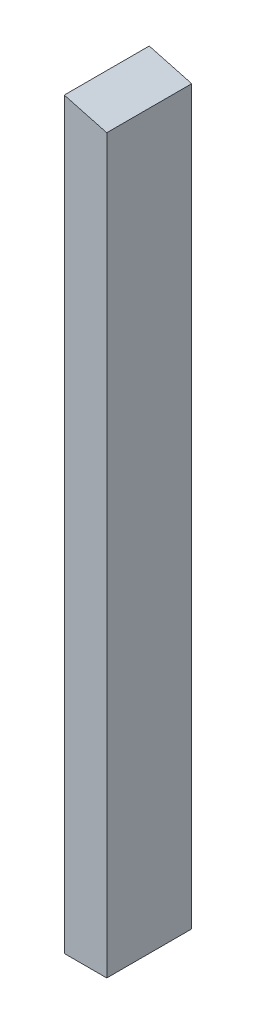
ISO-10303-21;
HEADER;
FILE_DESCRIPTION(('STEP AP214'),'2;1');
FILE_NAME('part.step','',(''),(''),'','','');
FILE_SCHEMA(('AUTOMOTIVE_DESIGN { 1 0 10303 214 1 1 1 1 }'));
ENDSEC;
DATA;
#1=APPLICATION_CONTEXT('core data for automotive mechanical design processes');
#2=APPLICATION_PROTOCOL_DEFINITION('international standard','automotive_design',2000,#1);
#3=PRODUCT_CONTEXT('',#1,'mechanical');
#4=PRODUCT('Part','Part','',(#3));
#5=PRODUCT_RELATED_PRODUCT_CATEGORY('part','',(#4));
#6=PRODUCT_DEFINITION_FORMATION('','',#4);
#7=PRODUCT_DEFINITION_CONTEXT('part definition',#1,'design');
#8=PRODUCT_DEFINITION('design','',#6,#7);
#9=PRODUCT_DEFINITION_SHAPE('','',#8);
#10=(LENGTH_UNIT() NAMED_UNIT(*) SI_UNIT(.MILLI.,.METRE.));
#11=(NAMED_UNIT(*) PLANE_ANGLE_UNIT() SI_UNIT($,.RADIAN.));
#12=(NAMED_UNIT(*) SI_UNIT($,.STERADIAN.) SOLID_ANGLE_UNIT());
#13=UNCERTAINTY_MEASURE_WITH_UNIT(LENGTH_MEASURE(1.E-05),#10,'distance_accuracy_value','');
#14=(GEOMETRIC_REPRESENTATION_CONTEXT(3) GLOBAL_UNCERTAINTY_ASSIGNED_CONTEXT((#13)) GLOBAL_UNIT_ASSIGNED_CONTEXT((#10,
#11,#12)) REPRESENTATION_CONTEXT('',''));
#15=CARTESIAN_POINT('',(0.,0.,0.));
#16=DIRECTION('',(0.,0.,1.));
#17=DIRECTION('',(1.,0.,0.));
#18=AXIS2_PLACEMENT_3D('',#15,#16,#17);
#19=CARTESIAN_POINT('',(3619.88097263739,2786.4066057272,-80.));
#20=DIRECTION('',(0.,-1.,0.));
#21=DIRECTION('',(0.,0.,-1.));
#22=AXIS2_PLACEMENT_3D('',#19,#20,#21);
#23=PLANE('',#22);
#24=DIRECTION('',(1.,0.,0.));
#25=VECTOR('',#24,1.);
#26=CARTESIAN_POINT('',(3619.88097263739,2786.4066057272,0.));
#27=LINE('',#26,#25);
#28=CARTESIAN_POINT('',(3619.88097263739,2786.4066057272,0.));
#29=VERTEX_POINT('',#28);
#30=CARTESIAN_POINT('',(3659.88097263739,2786.4066057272,0.));
#31=VERTEX_POINT('',#30);
#32=EDGE_CURVE('E136',#29,#31,#27,.T.);
#33=ORIENTED_EDGE('',*,*,#32,.F.);
#34=DIRECTION('',(0.,0.,1.));
#35=VECTOR('',#34,1.);
#36=CARTESIAN_POINT('',(3619.88097263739,2786.4066057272,-80.));
#37=LINE('',#36,#35);
#38=CARTESIAN_POINT('',(3619.88097263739,2786.4066057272,-80.));
#39=VERTEX_POINT('',#38);
#40=EDGE_CURVE('E153',#39,#29,#37,.T.);
#41=ORIENTED_EDGE('',*,*,#40,.F.);
#42=DIRECTION('',(1.,0.,0.));
#43=VECTOR('',#42,1.);
#44=CARTESIAN_POINT('',(3619.88097263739,2786.4066057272,-80.));
#45=LINE('',#44,#43);
#46=CARTESIAN_POINT('',(3659.88097263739,2786.4066057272,-80.));
#47=VERTEX_POINT('',#46);
#48=EDGE_CURVE('E147',#39,#47,#45,.T.);
#49=ORIENTED_EDGE('',*,*,#48,.T.);
#50=DIRECTION('',(0.,0.,1.));
#51=VECTOR('',#50,1.);
#52=CARTESIAN_POINT('',(3659.88097263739,2786.4066057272,-80.));
#53=LINE('',#52,#51);
#54=EDGE_CURVE('E35',#47,#31,#53,.T.);
#55=ORIENTED_EDGE('',*,*,#54,.T.);
#56=EDGE_LOOP('',(#33,#41,#49,#55));
#57=FACE_BOUND('',#56,.T.);
#58=DIRECTION('',(0.,0.,1.));
#59=VECTOR('',#58,1.);
#60=CARTESIAN_POINT('',(3622.88097263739,2786.4066057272,-80.));
#61=LINE('',#60,#59);
#62=CARTESIAN_POINT('',(3622.88097263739,2786.4066057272,-77.));
#63=VERTEX_POINT('',#62);
#64=CARTESIAN_POINT('',(3622.88097263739,2786.4066057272,-3.));
#65=VERTEX_POINT('',#64);
#66=EDGE_CURVE('E115',#63,#65,#61,.T.);
#67=ORIENTED_EDGE('',*,*,#66,.T.);
#68=DIRECTION('',(1.,0.,0.));
#69=VECTOR('',#68,1.);
#70=CARTESIAN_POINT('',(3619.88097263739,2786.4066057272,-3.));
#71=LINE('',#70,#69);
#72=CARTESIAN_POINT('',(3656.88097263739,2786.4066057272,-3.));
#73=VERTEX_POINT('',#72);
#74=EDGE_CURVE('E124',#65,#73,#71,.T.);
#75=ORIENTED_EDGE('',*,*,#74,.T.);
#76=DIRECTION('',(0.,0.,1.));
#77=VECTOR('',#76,1.);
#78=CARTESIAN_POINT('',(3656.88097263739,2786.4066057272,-80.));
#79=LINE('',#78,#77);
#80=CARTESIAN_POINT('',(3656.88097263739,2786.4066057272,-77.));
#81=VERTEX_POINT('',#80);
#82=EDGE_CURVE('E99',#81,#73,#79,.T.);
#83=ORIENTED_EDGE('',*,*,#82,.F.);
#84=DIRECTION('',(1.,0.,0.));
#85=VECTOR('',#84,1.);
#86=CARTESIAN_POINT('',(3619.88097263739,2786.4066057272,-77.));
#87=LINE('',#86,#85);
#88=EDGE_CURVE('E112',#63,#81,#87,.T.);
#89=ORIENTED_EDGE('',*,*,#88,.F.);
#90=EDGE_LOOP('',(#67,#75,#83,#89));
#91=FACE_BOUND('',#90,.T.);
#92=ADVANCED_FACE('F26',(#57,#91),#23,.T.);
#93=CARTESIAN_POINT('',(3659.88097263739,3475.68863802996,-80.));
#94=DIRECTION('',(0.258819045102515,0.96592582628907,0.));
#95=DIRECTION('',(-0.96592582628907,0.258819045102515,0.));
#96=AXIS2_PLACEMENT_3D('',#93,#94,#95);
#97=PLANE('',#96);
#98=DIRECTION('',(-0.96592582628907,0.258819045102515,0.));
#99=VECTOR('',#98,1.);
#100=CARTESIAN_POINT('',(3659.88097263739,3475.68863802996,0.));
#101=LINE('',#100,#99);
#102=CARTESIAN_POINT('',(3659.88097263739,3475.68863802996,0.));
#103=VERTEX_POINT('',#102);
#104=CARTESIAN_POINT('',(3619.88097263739,3486.4066057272,0.));
#105=VERTEX_POINT('',#104);
#106=EDGE_CURVE('E98',#103,#105,#101,.T.);
#107=ORIENTED_EDGE('',*,*,#106,.F.);
#108=DIRECTION('',(0.,0.,1.));
#109=VECTOR('',#108,1.);
#110=CARTESIAN_POINT('',(3659.88097263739,3475.68863802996,-80.));
#111=LINE('',#110,#109);
#112=CARTESIAN_POINT('',(3659.88097263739,3475.68863802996,-80.));
#113=VERTEX_POINT('',#112);
#114=EDGE_CURVE('E11',#113,#103,#111,.T.);
#115=ORIENTED_EDGE('',*,*,#114,.F.);
#116=DIRECTION('',(-0.96592582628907,0.258819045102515,0.));
#117=VECTOR('',#116,1.);
#118=CARTESIAN_POINT('',(3659.88097263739,3475.68863802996,-80.));
#119=LINE('',#118,#117);
#120=CARTESIAN_POINT('',(3619.88097263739,3486.4066057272,-80.));
#121=VERTEX_POINT('',#120);
#122=EDGE_CURVE('E142',#113,#121,#119,.T.);
#123=ORIENTED_EDGE('',*,*,#122,.T.);
#124=DIRECTION('',(0.,0.,1.));
#125=VECTOR('',#124,1.);
#126=CARTESIAN_POINT('',(3619.88097263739,3486.4066057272,-80.));
#127=LINE('',#126,#125);
#128=EDGE_CURVE('E30',#121,#105,#127,.T.);
#129=ORIENTED_EDGE('',*,*,#128,.T.);
#130=EDGE_LOOP('',(#107,#115,#123,#129));
#131=FACE_BOUND('',#130,.T.);
#132=ADVANCED_FACE('F28',(#131),#97,.T.);
#133=CARTESIAN_POINT('',(3659.88097263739,2786.4066057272,-80.));
#134=DIRECTION('',(1.,0.,0.));
#135=DIRECTION('',(0.,1.,0.));
#136=AXIS2_PLACEMENT_3D('',#133,#134,#135);
#137=PLANE('',#136);
#138=DIRECTION('',(0.,1.,0.));
#139=VECTOR('',#138,1.);
#140=CARTESIAN_POINT('',(3659.88097263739,2786.4066057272,0.));
#141=LINE('',#140,#139);
#142=EDGE_CURVE('E139',#31,#103,#141,.T.);
#143=ORIENTED_EDGE('',*,*,#142,.F.);
#144=ORIENTED_EDGE('',*,*,#54,.F.);
#145=DIRECTION('',(0.,1.,0.));
#146=VECTOR('',#145,1.);
#147=CARTESIAN_POINT('',(3659.88097263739,2786.4066057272,-80.));
#148=LINE('',#147,#146);
#149=EDGE_CURVE('E150',#47,#113,#148,.T.);
#150=ORIENTED_EDGE('',*,*,#149,.T.);
#151=ORIENTED_EDGE('',*,*,#114,.T.);
#152=EDGE_LOOP('',(#143,#144,#150,#151));
#153=FACE_BOUND('',#152,.T.);
#154=ADVANCED_FACE('F163',(#153),#137,.T.);
#155=CARTESIAN_POINT('',(3619.88097263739,3486.4066057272,-80.));
#156=DIRECTION('',(-1.,0.,0.));
#157=DIRECTION('',(0.,0.,1.));
#158=AXIS2_PLACEMENT_3D('',#155,#156,#157);
#159=PLANE('',#158);
#160=DIRECTION('',(0.,-1.,0.));
#161=VECTOR('',#160,1.);
#162=CARTESIAN_POINT('',(3619.88097263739,3486.4066057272,0.));
#163=LINE('',#162,#161);
#164=EDGE_CURVE('E133',#105,#29,#163,.T.);
#165=ORIENTED_EDGE('',*,*,#164,.F.);
#166=ORIENTED_EDGE('',*,*,#128,.F.);
#167=DIRECTION('',(0.,-1.,0.));
#168=VECTOR('',#167,1.);
#169=CARTESIAN_POINT('',(3619.88097263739,3486.4066057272,-80.));
#170=LINE('',#169,#168);
#171=EDGE_CURVE('E144',#121,#39,#170,.T.);
#172=ORIENTED_EDGE('',*,*,#171,.T.);
#173=ORIENTED_EDGE('',*,*,#40,.T.);
#174=EDGE_LOOP('',(#165,#166,#172,#173));
#175=FACE_BOUND('',#174,.T.);
#176=ADVANCED_FACE('F158',(#175),#159,.T.);
#177=CARTESIAN_POINT('',(3659.88097263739,3475.68863802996,-80.));
#178=DIRECTION('',(0.,0.,-1.));
#179=DIRECTION('',(-1.,0.,0.));
#180=AXIS2_PLACEMENT_3D('',#177,#178,#179);
#181=PLANE('',#180);
#182=ORIENTED_EDGE('',*,*,#122,.F.);
#183=ORIENTED_EDGE('',*,*,#149,.F.);
#184=ORIENTED_EDGE('',*,*,#48,.F.);
#185=ORIENTED_EDGE('',*,*,#171,.F.);
#186=EDGE_LOOP('',(#182,#183,#184,#185));
#187=FACE_BOUND('',#186,.T.);
#188=ADVANCED_FACE('F167',(#187),#181,.T.);
#189=CARTESIAN_POINT('',(3659.88097263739,3475.68863802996,0.));
#190=DIRECTION('',(0.,0.,-1.));
#191=DIRECTION('',(-1.,0.,0.));
#192=AXIS2_PLACEMENT_3D('',#189,#190,#191);
#193=PLANE('',#192);
#194=ORIENTED_EDGE('',*,*,#106,.T.);
#195=ORIENTED_EDGE('',*,*,#164,.T.);
#196=ORIENTED_EDGE('',*,*,#32,.T.);
#197=ORIENTED_EDGE('',*,*,#142,.T.);
#198=EDGE_LOOP('',(#194,#195,#196,#197));
#199=FACE_BOUND('',#198,.T.);
#200=ADVANCED_FACE('F160',(#199),#193,.F.);
#201=CARTESIAN_POINT('',(3659.10451550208,3472.79086055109,-80.));
#202=DIRECTION('',(0.258819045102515,0.96592582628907,0.));
#203=DIRECTION('',(-0.96592582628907,0.258819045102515,0.));
#204=AXIS2_PLACEMENT_3D('',#201,#202,#203);
#205=PLANE('',#204);
#206=DIRECTION('',(-0.96592582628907,0.258819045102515,0.));
#207=VECTOR('',#206,1.);
#208=CARTESIAN_POINT('',(3659.10451550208,3472.79086055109,-3.));
#209=LINE('',#208,#207);
#210=CARTESIAN_POINT('',(3656.88097263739,3473.38665706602,-3.));
#211=VERTEX_POINT('',#210);
#212=CARTESIAN_POINT('',(3622.88097263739,3482.49692960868,-3.));
#213=VERTEX_POINT('',#212);
#214=EDGE_CURVE('E125',#211,#213,#209,.T.);
#215=ORIENTED_EDGE('',*,*,#214,.T.);
#216=DIRECTION('',(0.,0.,1.));
#217=VECTOR('',#216,1.);
#218=CARTESIAN_POINT('',(3622.88097263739,3482.49692960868,-80.));
#219=LINE('',#218,#217);
#220=CARTESIAN_POINT('',(3622.88097263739,3482.49692960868,-77.));
#221=VERTEX_POINT('',#220);
#222=EDGE_CURVE('E104',#221,#213,#219,.T.);
#223=ORIENTED_EDGE('',*,*,#222,.F.);
#224=DIRECTION('',(-0.96592582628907,0.258819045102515,0.));
#225=VECTOR('',#224,1.);
#226=CARTESIAN_POINT('',(3659.10451550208,3472.79086055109,-77.));
#227=LINE('',#226,#225);
#228=CARTESIAN_POINT('',(3656.88097263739,3473.38665706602,-77.));
#229=VERTEX_POINT('',#228);
#230=EDGE_CURVE('E102',#229,#221,#227,.T.);
#231=ORIENTED_EDGE('',*,*,#230,.F.);
#232=DIRECTION('',(0.,0.,1.));
#233=VECTOR('',#232,1.);
#234=CARTESIAN_POINT('',(3656.88097263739,3473.38665706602,-80.));
#235=LINE('',#234,#233);
#236=EDGE_CURVE('E90',#229,#211,#235,.T.);
#237=ORIENTED_EDGE('',*,*,#236,.T.);
#238=EDGE_LOOP('',(#215,#223,#231,#237));
#239=FACE_BOUND('',#238,.T.);
#240=ADVANCED_FACE('F103',(#239),#205,.F.);
#241=CARTESIAN_POINT('',(3656.88097263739,2786.4066057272,-80.));
#242=DIRECTION('',(1.,0.,0.));
#243=DIRECTION('',(0.,1.,0.));
#244=AXIS2_PLACEMENT_3D('',#241,#242,#243);
#245=PLANE('',#244);
#246=DIRECTION('',(0.,1.,0.));
#247=VECTOR('',#246,1.);
#248=CARTESIAN_POINT('',(3656.88097263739,2786.4066057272,-3.));
#249=LINE('',#248,#247);
#250=EDGE_CURVE('E94',#73,#211,#249,.T.);
#251=ORIENTED_EDGE('',*,*,#250,.T.);
#252=ORIENTED_EDGE('',*,*,#236,.F.);
#253=DIRECTION('',(0.,1.,0.));
#254=VECTOR('',#253,1.);
#255=CARTESIAN_POINT('',(3656.88097263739,2786.4066057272,-77.));
#256=LINE('',#255,#254);
#257=EDGE_CURVE('E43',#81,#229,#256,.T.);
#258=ORIENTED_EDGE('',*,*,#257,.F.);
#259=ORIENTED_EDGE('',*,*,#82,.T.);
#260=EDGE_LOOP('',(#251,#252,#258,#259));
#261=FACE_BOUND('',#260,.T.);
#262=ADVANCED_FACE('F92',(#261),#245,.F.);
#263=CARTESIAN_POINT('',(3622.88097263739,3486.4066057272,-80.));
#264=DIRECTION('',(-1.,0.,0.));
#265=DIRECTION('',(0.,0.,1.));
#266=AXIS2_PLACEMENT_3D('',#263,#264,#265);
#267=PLANE('',#266);
#268=DIRECTION('',(0.,-1.,0.));
#269=VECTOR('',#268,1.);
#270=CARTESIAN_POINT('',(3622.88097263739,3486.4066057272,-3.));
#271=LINE('',#270,#269);
#272=EDGE_CURVE('E121',#213,#65,#271,.T.);
#273=ORIENTED_EDGE('',*,*,#272,.T.);
#274=ORIENTED_EDGE('',*,*,#66,.F.);
#275=DIRECTION('',(0.,-1.,0.));
#276=VECTOR('',#275,1.);
#277=CARTESIAN_POINT('',(3622.88097263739,3486.4066057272,-77.));
#278=LINE('',#277,#276);
#279=EDGE_CURVE('E108',#221,#63,#278,.T.);
#280=ORIENTED_EDGE('',*,*,#279,.F.);
#281=ORIENTED_EDGE('',*,*,#222,.T.);
#282=EDGE_LOOP('',(#273,#274,#280,#281));
#283=FACE_BOUND('',#282,.T.);
#284=ADVANCED_FACE('F173',(#283),#267,.F.);
#285=CARTESIAN_POINT('',(3659.88097263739,3475.68863802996,-77.));
#286=DIRECTION('',(0.,0.,-1.));
#287=DIRECTION('',(-1.,0.,0.));
#288=AXIS2_PLACEMENT_3D('',#285,#286,#287);
#289=PLANE('',#288);
#290=ORIENTED_EDGE('',*,*,#230,.T.);
#291=ORIENTED_EDGE('',*,*,#279,.T.);
#292=ORIENTED_EDGE('',*,*,#88,.T.);
#293=ORIENTED_EDGE('',*,*,#257,.T.);
#294=EDGE_LOOP('',(#290,#291,#292,#293));
#295=FACE_BOUND('',#294,.T.);
#296=ADVANCED_FACE('F110',(#295),#289,.F.);
#297=CARTESIAN_POINT('',(3659.88097263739,3475.68863802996,-3.));
#298=DIRECTION('',(0.,0.,-1.));
#299=DIRECTION('',(-1.,0.,0.));
#300=AXIS2_PLACEMENT_3D('',#297,#298,#299);
#301=PLANE('',#300);
#302=ORIENTED_EDGE('',*,*,#214,.F.);
#303=ORIENTED_EDGE('',*,*,#250,.F.);
#304=ORIENTED_EDGE('',*,*,#74,.F.);
#305=ORIENTED_EDGE('',*,*,#272,.F.);
#306=EDGE_LOOP('',(#302,#303,#304,#305));
#307=FACE_BOUND('',#306,.T.);
#308=ADVANCED_FACE('F176',(#307),#301,.T.);
#309=CLOSED_SHELL('',(#92,#132,#154,#176,#188,#200,#240,#262,#284,#296,#308));
#310=MANIFOLD_SOLID_BREP('B2',#309);
#311=ADVANCED_BREP_SHAPE_REPRESENTATION('',(#18,#310),#14);
#312=SHAPE_DEFINITION_REPRESENTATION(#9,#311);
ENDSEC;
END-ISO-10303-21;
